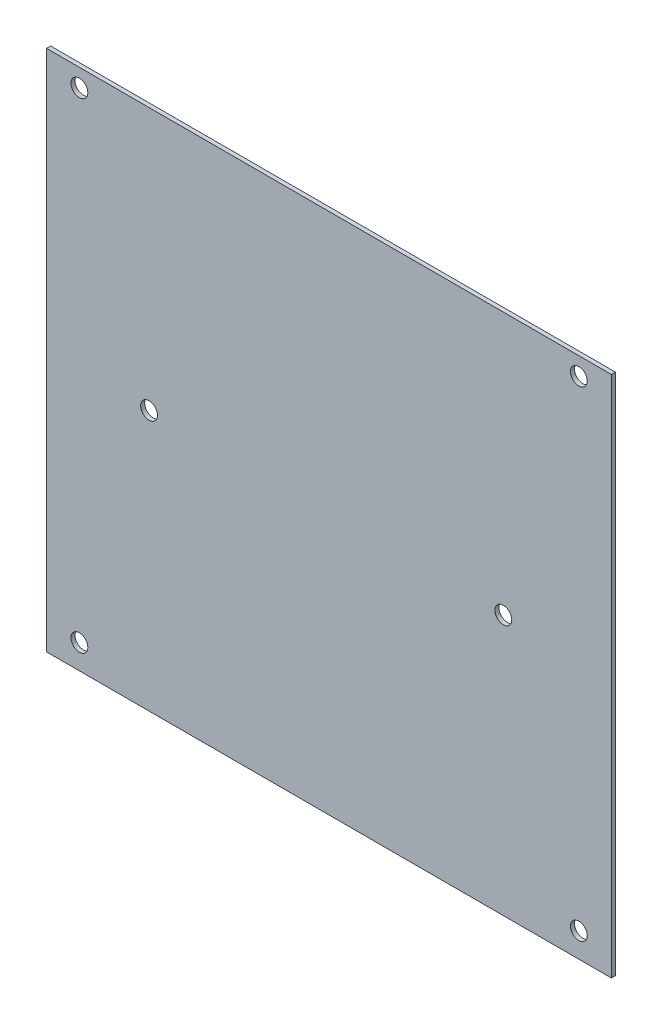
from build123d import *

# Parameters (mm, degrees)
SKETCH1_W                                      = 97.25
SKETCH1_H                                      = 90
BOSS_EXTRUDE1_DEPTH                            = 2
SKETCH2_R                                      = 1.025
CUT_EXTRUDE1_DEPTH                             = 2
CSK_FOR_M2_5_FLAT_HEAD_MACHINE_SCREW1_AT_COUNT = 2
CSK_FOR_M2_5_FLAT_HEAD_MACHINE_SCREW1_AT_PITCH = 86
CSK_FOR_M2_5_FLAT_HEAD_MACHINE_SCREW_2_COUNT   = 2
CSK_FOR_M2_5_FLAT_HEAD_MACHINE_SCREW_2_PITCH   = 85.137594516
CSK_FOR_M2_5_FLAT_HEAD_MACHINE_SCREW_3_COUNT   = 2
CSK_FOR_M2_5_FLAT_HEAD_MACHINE_SCREW_3_PITCH   = 119.311734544
CSK_FOR_M2_5_FLAT_HEAD_MACHINE_SCREW_4_COUNT   = 2
CSK_FOR_M2_5_FLAT_HEAD_MACHINE_SCREW_4_PITCH   = 82.7
CSK_FOR_M2_5_FLAT_HEAD_MACHINE_SCREW_5_COUNT   = 2
CSK_FOR_M2_5_FLAT_HEAD_MACHINE_SCREW_5_PITCH   = 44.061434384
SKETCH5_W                                      = 97.25
SKETCH5_H                                      = 90
CUT_EXTRUDE2_DEPTH                             = 1.3


with BuildPart() as part:
    # Sketch1 → Boss-Extrude1 (new body)
    with BuildSketch(Plane.XY):
        with Locations((48.625, 45)):
            Rectangle(SKETCH1_W, SKETCH1_H)
    extrude(amount=BOSS_EXTRUDE1_DEPTH)

    # Sketch2 → Cut-Extrude1 (cut)
    with BuildSketch(Plane(origin=(0, 0, 0), x_dir=(-1, 0, 0), z_dir=(0, 0, -1))):
        with Locations((-5.65, 86.925)):
            Circle(SKETCH2_R)
        with Locations((-91.65, 86.925)):
            Circle(SKETCH2_R)
        with Locations((-17.65, 44.825)):
            Circle(SKETCH2_R)
        with Locations((-78.65, 44.825)):
            Circle(SKETCH2_R)
        with Locations((-5.65, 4.225)):
            Circle(SKETCH2_R)
        with Locations((-91.65, 4.225)):
            Circle(SKETCH2_R)
    extrude(amount=-CUT_EXTRUDE1_DEPTH, mode=Mode.SUBTRACT)

    # Sketch3 → CSK for M2.5 Flat Head Machine Screw1 (revolve, cut)
    with BuildSketch(Plane(origin=(91.65, 86.925, 2), x_dir=(0, -1, 0), z_dir=(1, 0, 0))):
        Polygon((0, 0), (0, 2), (1.45, 2), (1.45, 1.3), (2.75, 0), align=None)
    csk_for_m2_5_flat_head_machine_screw1 = revolve(axis=Axis((91.65, 86.925, 8.35), (0, 0, -1)), mode=Mode.SUBTRACT)

    # CSK for M2.5 Flat Head Machine Screw1 at: CSK for M2.5 Flat Head Machine Screw1 ×2
    with Locations(*[(-i * CSK_FOR_M2_5_FLAT_HEAD_MACHINE_SCREW1_AT_PITCH, 0, 0) for i in range(1, CSK_FOR_M2_5_FLAT_HEAD_MACHINE_SCREW1_AT_COUNT)]):
        add(csk_for_m2_5_flat_head_machine_screw1, mode=Mode.SUBTRACT)

    # CSK for M2.5 Flat Head Machine Screw 2: CSK for M2.5 Flat Head Machine Screw1 ×2
    with Locations(*[Vector(-0.8691812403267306, -0.49449365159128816, 0) * (i * CSK_FOR_M2_5_FLAT_HEAD_MACHINE_SCREW_2_PITCH) for i in range(1, CSK_FOR_M2_5_FLAT_HEAD_MACHINE_SCREW_2_COUNT)]):
        add(csk_for_m2_5_flat_head_machine_screw1, mode=Mode.SUBTRACT)

    # CSK for M2.5 Flat Head Machine Screw 3: CSK for M2.5 Flat Head Machine Screw1 ×2
    with Locations(*[Vector(-0.7208008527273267, -0.6931422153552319, 0) * (i * CSK_FOR_M2_5_FLAT_HEAD_MACHINE_SCREW_3_PITCH) for i in range(1, CSK_FOR_M2_5_FLAT_HEAD_MACHINE_SCREW_3_COUNT)]):
        add(csk_for_m2_5_flat_head_machine_screw1, mode=Mode.SUBTRACT)

    # CSK for M2.5 Flat Head Machine Screw 4: CSK for M2.5 Flat Head Machine Screw1 ×2
    with Locations(*[(0, -i * CSK_FOR_M2_5_FLAT_HEAD_MACHINE_SCREW_4_PITCH, 0) for i in range(1, CSK_FOR_M2_5_FLAT_HEAD_MACHINE_SCREW_4_COUNT)]):
        add(csk_for_m2_5_flat_head_machine_screw1, mode=Mode.SUBTRACT)

    # CSK for M2.5 Flat Head Machine Screw 5: CSK for M2.5 Flat Head Machine Screw1 ×2
    with Locations(*[Vector(-0.2950425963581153, -0.955484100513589, 0) * (i * CSK_FOR_M2_5_FLAT_HEAD_MACHINE_SCREW_5_PITCH) for i in range(1, CSK_FOR_M2_5_FLAT_HEAD_MACHINE_SCREW_5_COUNT)]):
        add(csk_for_m2_5_flat_head_machine_screw1, mode=Mode.SUBTRACT)

    # Sketch5 → Cut-Extrude2 (cut)
    with BuildSketch(Plane.XY.offset(2)):
        with Locations((48.625, 45)):
            Rectangle(SKETCH5_W, SKETCH5_H)
    extrude(amount=-CUT_EXTRUDE2_DEPTH, mode=Mode.SUBTRACT)


solid = part.part
